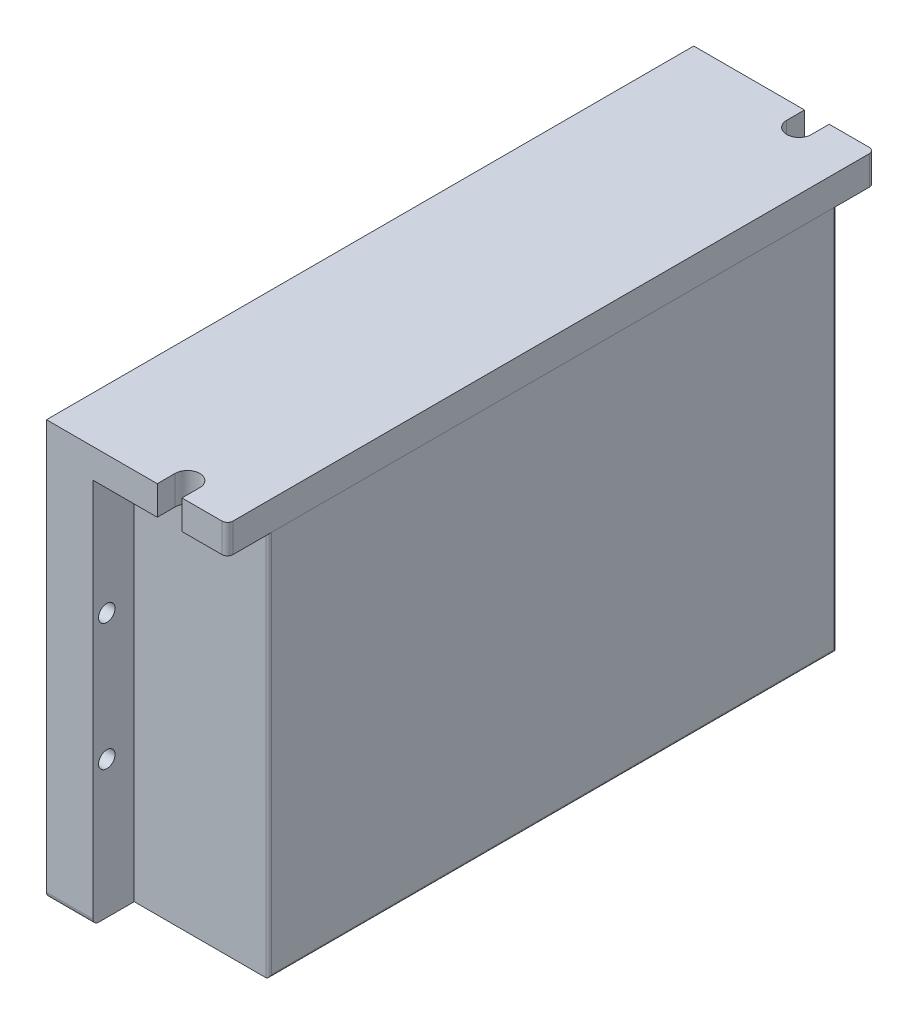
from build123d import *

# Parameters (mm, degrees)
SKETCH_1_W          = 118
SKETCH_1_H          = 75.6
EXTRUDE_1_DEPTH     = 8.5
SKETCH_2_W          = 118
SKETCH_2_H          = 5.3
EXTRUDE_2_DEPTH     = 24.5
SKETCH_3_W          = 103.5
SKETCH_3_H          = 70.3
EXTRUDE_3_DEPTH     = 24.5
CUT_EXTRUDE_1_DEPTH = 5.3
FILLET_1_R          = 0.5
FILLET_2_R          = 1
SKETCH_5_R          = 1.5
CUT_EXTRUDE_2_DEPTH = 8.5


with BuildPart() as part:
    # Sketch 1 → Extrude 1 (new body)
    with BuildSketch(Plane(origin=(0, 0, 0), x_dir=(0, 0, -1), z_dir=(1, 0, 0))):
        Rectangle(SKETCH_1_W, SKETCH_1_H)
    extrude(amount=EXTRUDE_1_DEPTH)

    # Sketch 2 → Extrude 2 (add)
    with BuildSketch(Plane(origin=(8.5, 0, 0), x_dir=(0, 0, -1), z_dir=(1, 0, 0))):
        with Locations((0, 35.15)):
            Rectangle(SKETCH_2_W, SKETCH_2_H)
    extrude(amount=EXTRUDE_2_DEPTH)

    # Sketch 4 → Cut-Extrude 1 (cut)
    with BuildSketch(Plane(origin=(0, 37.8, 0), x_dir=(1, 0, 0), z_dir=(0, 1, 0))):
        with BuildLine():
            Line((20.2, 55.75), (20.2, 59))
            Line((20.2, 59), (24.7, 59))
            Line((24.7, 59), (24.7, 55.75))
            ThreePointArc((24.7, 55.75), (22.45, 53.5), (20.2, 55.75))
        make_face()
        with BuildLine():
            Line((20.2, -55.75), (20.2, -59))
            Line((20.2, -59), (24.7, -59))
            Line((24.7, -59), (24.7, -55.75))
            ThreePointArc((24.7, -55.75), (22.45, -53.5), (20.2, -55.75))
        make_face()
    extrude(amount=-CUT_EXTRUDE_1_DEPTH, mode=Mode.SUBTRACT)

    # Fillet 2
    fillet_2_edges = [part.edges().sort_by_distance(p)[0] for p in [
        (33, 35.15, -59),
        (33, 35.15, 59),
        (4.25, -37.8, 59),
        (4.25, -37.8, -59),
    ]]
    fillet(fillet_2_edges, radius=FILLET_2_R)

    # Sketch 5 → Cut-Extrude 2 (cut)
    with BuildSketch(Plane(origin=(8.5, 0, 0), x_dir=(0, 0, -1), z_dir=(1, 0, 0))):
        with Locations((-56.5, -12.8)):
            Circle(SKETCH_5_R)
        with Locations((56.5, -12.8)):
            Circle(SKETCH_5_R)
        with Locations((-56.5, 10.3)):
            Circle(SKETCH_5_R)
        with Locations((56.5, 10.3)):
            Circle(SKETCH_5_R)
    extrude(amount=-CUT_EXTRUDE_2_DEPTH, mode=Mode.SUBTRACT)


with BuildPart() as body_2:
    # Sketch 3 → Extrude 3 (new body)
    with BuildSketch(Plane(origin=(8.5, 0, 0), x_dir=(0, 0, -1), z_dir=(1, 0, 0))):
        with Locations((0.25, -2.65)):
            Rectangle(SKETCH_3_W, SKETCH_3_H)
    extrude(amount=EXTRUDE_3_DEPTH)

    # Fillet 1
    fillet_1_edges = [body_2.edges().sort_by_distance(p)[0] for p in [
        (33, -37.8, -0.25),
        (33, -2.65, -52),
        (33, -2.65, 51.5),
    ]]
    fillet(fillet_1_edges, radius=FILLET_1_R)


solid = Compound([part.part, body_2.part])
